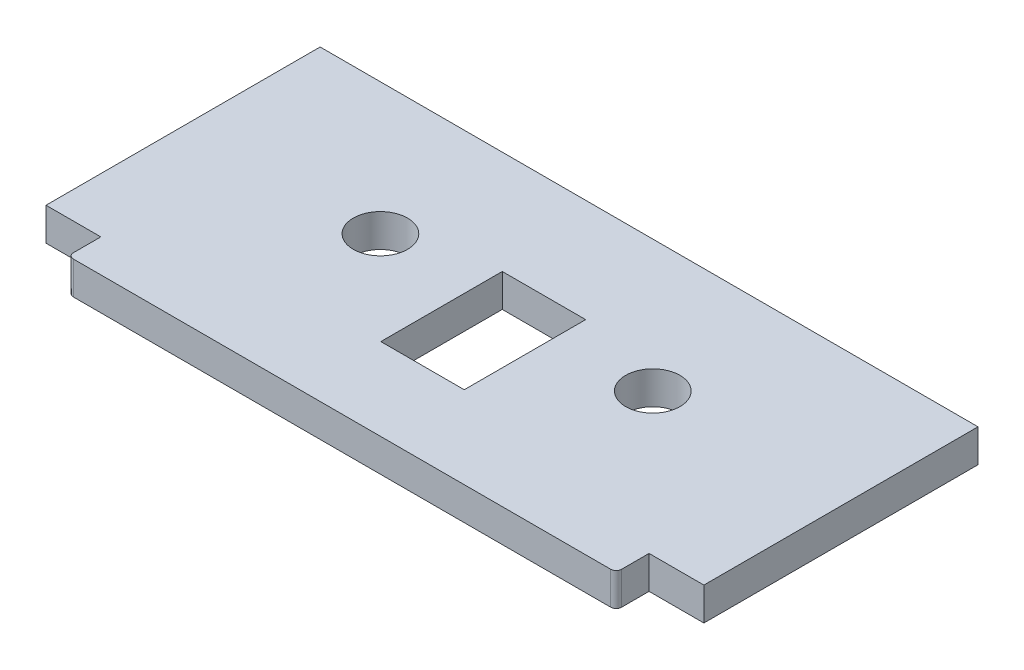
from build123d import *

# Parameters (mm, degrees)
SKETCH1_R           = 4.95
BOSS_EXTRUDE2_DEPTH = 6
FILLET2_R           = 1


with BuildPart() as part:
    # Sketch1 → Boss-Extrude2 (new body)
    with BuildSketch(Plane(origin=(0, 0, 0), x_dir=(1, 0, 0), z_dir=(0, 1, 0))):
        Polygon((-59.682936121, 16.844075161), (60.317063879, 16.844075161), (60.317063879, -33.155924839), (50.317063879, -33.155924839), (50.317063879, -39.155924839), (-49.682936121, -39.155924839), (-49.682936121, -33.155924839), (-59.682936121, -33.155924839), align=None)
        with Locations(Location((-24.682936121, -7.155924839, 0), (0, 0, 270))):
            Circle(SKETCH1_R, mode=Mode.SUBTRACT)
        with Locations(Location((25, -7.155924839, 0), (0, 0, 90))):
            Circle(SKETCH1_R, mode=Mode.SUBTRACT)
        Polygon((-7.607224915, -18.155924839), (-7.607224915, -24.155924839), (7.607224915, -24.155924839), (7.607224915, -18.155924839), (7.607224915, -2.005414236), (-7.607224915, -2.005414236), align=None, mode=Mode.SUBTRACT)
    extrude(amount=BOSS_EXTRUDE2_DEPTH)

    # Fillet2
    fillet2_edges = [part.edges().sort_by_distance(p)[0] for p in [
        (50.317063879, 3, 39.155924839),
        (-49.682936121, 3, 39.155924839),
    ]]
    fillet(fillet2_edges, radius=FILLET2_R)


solid = part.part
